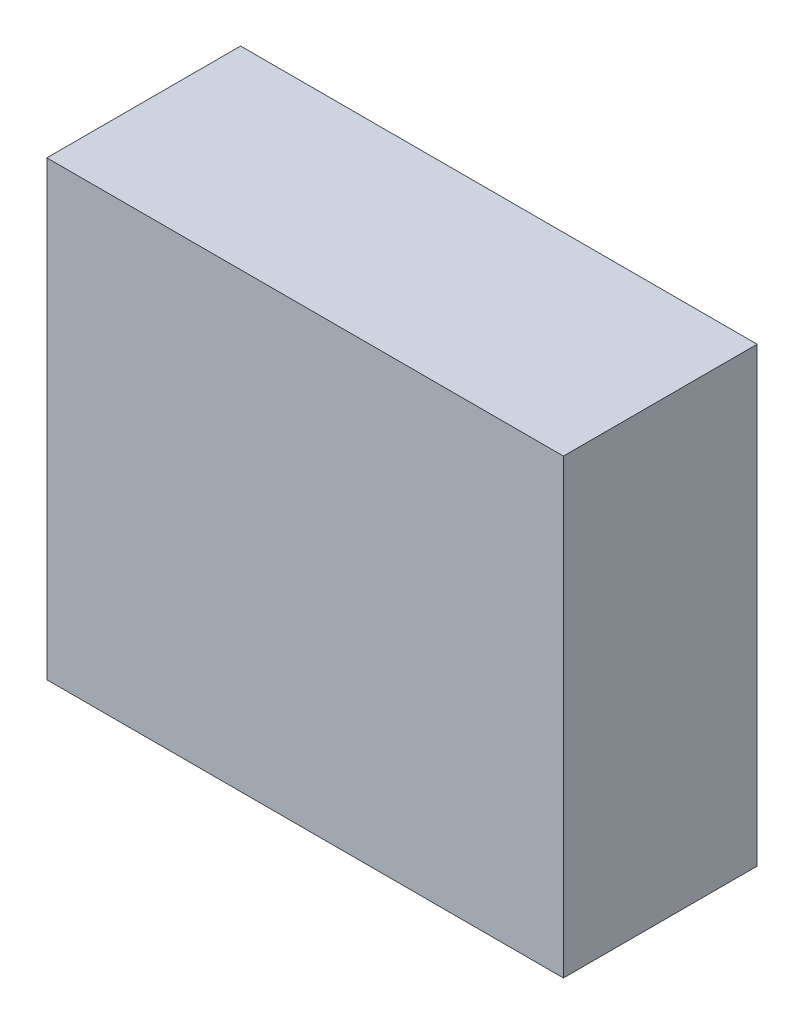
ISO-10303-21;
HEADER;
FILE_DESCRIPTION(('STEP AP214'),'2;1');
FILE_NAME('part.step','',(''),(''),'','','');
FILE_SCHEMA(('AUTOMOTIVE_DESIGN { 1 0 10303 214 1 1 1 1 }'));
ENDSEC;
DATA;
#1=APPLICATION_CONTEXT('core data for automotive mechanical design processes');
#2=APPLICATION_PROTOCOL_DEFINITION('international standard','automotive_design',2000,#1);
#3=PRODUCT_CONTEXT('',#1,'mechanical');
#4=PRODUCT('Part','Part','',(#3));
#5=PRODUCT_RELATED_PRODUCT_CATEGORY('part','',(#4));
#6=PRODUCT_DEFINITION_FORMATION('','',#4);
#7=PRODUCT_DEFINITION_CONTEXT('part definition',#1,'design');
#8=PRODUCT_DEFINITION('design','',#6,#7);
#9=PRODUCT_DEFINITION_SHAPE('','',#8);
#10=(LENGTH_UNIT() NAMED_UNIT(*) SI_UNIT(.MILLI.,.METRE.));
#11=(NAMED_UNIT(*) PLANE_ANGLE_UNIT() SI_UNIT($,.RADIAN.));
#12=(NAMED_UNIT(*) SI_UNIT($,.STERADIAN.) SOLID_ANGLE_UNIT());
#13=UNCERTAINTY_MEASURE_WITH_UNIT(LENGTH_MEASURE(1.E-05),#10,'distance_accuracy_value','');
#14=(GEOMETRIC_REPRESENTATION_CONTEXT(3) GLOBAL_UNCERTAINTY_ASSIGNED_CONTEXT((#13)) GLOBAL_UNIT_ASSIGNED_CONTEXT((#10,
#11,#12)) REPRESENTATION_CONTEXT('',''));
#15=CARTESIAN_POINT('',(0.,0.,0.));
#16=DIRECTION('',(0.,0.,1.));
#17=DIRECTION('',(1.,0.,0.));
#18=AXIS2_PLACEMENT_3D('',#15,#16,#17);
#19=CARTESIAN_POINT('',(-1.1999976,-1.04999536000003,0.));
#20=DIRECTION('',(-1.,0.,0.));
#21=DIRECTION('',(0.,1.,0.));
#22=AXIS2_PLACEMENT_3D('',#19,#20,#21);
#23=PLANE('',#22);
#24=DIRECTION('',(0.,0.,1.));
#25=VECTOR('',#24,1.);
#26=CARTESIAN_POINT('',(-1.1999976,-1.04999536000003,0.));
#27=LINE('',#26,#25);
#28=CARTESIAN_POINT('',(-1.1999976,-1.04999536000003,0.));
#29=VERTEX_POINT('',#28);
#30=CARTESIAN_POINT('',(-1.1999976,-1.04999536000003,0.90000074));
#31=VERTEX_POINT('',#30);
#32=EDGE_CURVE('E11',#29,#31,#27,.T.);
#33=ORIENTED_EDGE('',*,*,#32,.T.);
#34=DIRECTION('',(0.,1.,0.));
#35=VECTOR('',#34,1.);
#36=CARTESIAN_POINT('',(-1.1999976,-1.04999536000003,0.90000074));
#37=LINE('',#36,#35);
#38=CARTESIAN_POINT('',(-1.1999976,1.05000297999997,0.90000074));
#39=VERTEX_POINT('',#38);
#40=EDGE_CURVE('E24',#31,#39,#37,.T.);
#41=ORIENTED_EDGE('',*,*,#40,.T.);
#42=DIRECTION('',(0.,0.,1.));
#43=VECTOR('',#42,1.);
#44=CARTESIAN_POINT('',(-1.1999976,1.05000297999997,0.));
#45=LINE('',#44,#43);
#46=CARTESIAN_POINT('',(-1.1999976,1.05000297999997,0.));
#47=VERTEX_POINT('',#46);
#48=EDGE_CURVE('E85',#47,#39,#45,.T.);
#49=ORIENTED_EDGE('',*,*,#48,.F.);
#50=DIRECTION('',(0.,1.,0.));
#51=VECTOR('',#50,1.);
#52=CARTESIAN_POINT('',(-1.1999976,-1.04999536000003,0.));
#53=LINE('',#52,#51);
#54=EDGE_CURVE('E83',#29,#47,#53,.T.);
#55=ORIENTED_EDGE('',*,*,#54,.F.);
#56=EDGE_LOOP('',(#33,#41,#49,#55));
#57=FACE_BOUND('',#56,.T.);
#58=ADVANCED_FACE('F17',(#57),#23,.T.);
#59=CARTESIAN_POINT('',(-1.1999976,1.05000297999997,0.));
#60=DIRECTION('',(0.,1.,0.));
#61=DIRECTION('',(1.,0.,0.));
#62=AXIS2_PLACEMENT_3D('',#59,#60,#61);
#63=PLANE('',#62);
#64=ORIENTED_EDGE('',*,*,#48,.T.);
#65=DIRECTION('',(1.,0.,0.));
#66=VECTOR('',#65,1.);
#67=CARTESIAN_POINT('',(-1.1999976,1.05000297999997,0.90000074));
#68=LINE('',#67,#66);
#69=CARTESIAN_POINT('',(1.20000014,1.05000297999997,0.90000074));
#70=VERTEX_POINT('',#69);
#71=EDGE_CURVE('E81',#39,#70,#68,.T.);
#72=ORIENTED_EDGE('',*,*,#71,.T.);
#73=DIRECTION('',(0.,0.,1.));
#74=VECTOR('',#73,1.);
#75=CARTESIAN_POINT('',(1.20000014,1.05000297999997,0.));
#76=LINE('',#75,#74);
#77=CARTESIAN_POINT('',(1.20000014,1.05000297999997,0.));
#78=VERTEX_POINT('',#77);
#79=EDGE_CURVE('E79',#78,#70,#76,.T.);
#80=ORIENTED_EDGE('',*,*,#79,.F.);
#81=DIRECTION('',(1.,0.,0.));
#82=VECTOR('',#81,1.);
#83=CARTESIAN_POINT('',(-1.1999976,1.05000297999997,0.));
#84=LINE('',#83,#82);
#85=EDGE_CURVE('E61',#47,#78,#84,.T.);
#86=ORIENTED_EDGE('',*,*,#85,.F.);
#87=EDGE_LOOP('',(#64,#72,#80,#86));
#88=FACE_BOUND('',#87,.T.);
#89=ADVANCED_FACE('F90',(#88),#63,.T.);
#90=CARTESIAN_POINT('',(1.20000014,1.05000297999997,0.));
#91=DIRECTION('',(1.,0.,0.));
#92=DIRECTION('',(0.,-1.,0.));
#93=AXIS2_PLACEMENT_3D('',#90,#91,#92);
#94=PLANE('',#93);
#95=ORIENTED_EDGE('',*,*,#79,.T.);
#96=DIRECTION('',(0.,-1.,0.));
#97=VECTOR('',#96,1.);
#98=CARTESIAN_POINT('',(1.20000014,1.05000297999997,0.90000074));
#99=LINE('',#98,#97);
#100=CARTESIAN_POINT('',(1.20000014,-1.04999790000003,0.90000074));
#101=VERTEX_POINT('',#100);
#102=EDGE_CURVE('E70',#70,#101,#99,.T.);
#103=ORIENTED_EDGE('',*,*,#102,.T.);
#104=DIRECTION('',(0.,0.,1.));
#105=VECTOR('',#104,1.);
#106=CARTESIAN_POINT('',(1.20000014,-1.04999790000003,0.));
#107=LINE('',#106,#105);
#108=CARTESIAN_POINT('',(1.20000014,-1.04999790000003,0.));
#109=VERTEX_POINT('',#108);
#110=EDGE_CURVE('E64',#109,#101,#107,.T.);
#111=ORIENTED_EDGE('',*,*,#110,.F.);
#112=DIRECTION('',(0.,-1.,0.));
#113=VECTOR('',#112,1.);
#114=CARTESIAN_POINT('',(1.20000014,1.05000297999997,0.));
#115=LINE('',#114,#113);
#116=EDGE_CURVE('E55',#78,#109,#115,.T.);
#117=ORIENTED_EDGE('',*,*,#116,.F.);
#118=EDGE_LOOP('',(#95,#103,#111,#117));
#119=FACE_BOUND('',#118,.T.);
#120=ADVANCED_FACE('F68',(#119),#94,.T.);
#121=CARTESIAN_POINT('',(1.20000014,-1.04999790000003,0.));
#122=DIRECTION('',(-1.05833436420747E-06,-0.99999999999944,0.));
#123=DIRECTION('',(-0.99999999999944,1.05833436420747E-06,0.));
#124=AXIS2_PLACEMENT_3D('',#121,#122,#123);
#125=PLANE('',#124);
#126=ORIENTED_EDGE('',*,*,#110,.T.);
#127=DIRECTION('',(-0.99999999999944,1.05833436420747E-06,0.));
#128=VECTOR('',#127,1.);
#129=CARTESIAN_POINT('',(1.20000014,-1.04999790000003,0.90000074));
#130=LINE('',#129,#128);
#131=EDGE_CURVE('E65',#101,#31,#130,.T.);
#132=ORIENTED_EDGE('',*,*,#131,.T.);
#133=ORIENTED_EDGE('',*,*,#32,.F.);
#134=DIRECTION('',(-0.99999999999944,1.05833436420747E-06,0.));
#135=VECTOR('',#134,1.);
#136=CARTESIAN_POINT('',(1.20000014,-1.04999790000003,0.));
#137=LINE('',#136,#135);
#138=EDGE_CURVE('E59',#109,#29,#137,.T.);
#139=ORIENTED_EDGE('',*,*,#138,.F.);
#140=EDGE_LOOP('',(#126,#132,#133,#139));
#141=FACE_BOUND('',#140,.T.);
#142=ADVANCED_FACE('F73',(#141),#125,.T.);
#143=CARTESIAN_POINT('',(-1.1999976,-1.04999536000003,0.));
#144=DIRECTION('',(0.,0.,1.));
#145=DIRECTION('',(1.,0.,0.));
#146=AXIS2_PLACEMENT_3D('',#143,#144,#145);
#147=PLANE('',#146);
#148=ORIENTED_EDGE('',*,*,#54,.T.);
#149=ORIENTED_EDGE('',*,*,#85,.T.);
#150=ORIENTED_EDGE('',*,*,#116,.T.);
#151=ORIENTED_EDGE('',*,*,#138,.T.);
#152=EDGE_LOOP('',(#148,#149,#150,#151));
#153=FACE_BOUND('',#152,.T.);
#154=ADVANCED_FACE('F58',(#153),#147,.F.);
#155=CARTESIAN_POINT('',(-1.1999976,-1.04999536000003,0.90000074));
#156=DIRECTION('',(0.,0.,1.));
#157=DIRECTION('',(1.,0.,0.));
#158=AXIS2_PLACEMENT_3D('',#155,#156,#157);
#159=PLANE('',#158);
#160=ORIENTED_EDGE('',*,*,#131,.F.);
#161=ORIENTED_EDGE('',*,*,#102,.F.);
#162=ORIENTED_EDGE('',*,*,#71,.F.);
#163=ORIENTED_EDGE('',*,*,#40,.F.);
#164=EDGE_LOOP('',(#160,#161,#162,#163));
#165=FACE_BOUND('',#164,.T.);
#166=ADVANCED_FACE('F91',(#165),#159,.T.);
#167=CLOSED_SHELL('',(#58,#89,#120,#142,#154,#166));
#168=MANIFOLD_SOLID_BREP('B1',#167);
#169=ADVANCED_BREP_SHAPE_REPRESENTATION('',(#18,#168),#14);
#170=SHAPE_DEFINITION_REPRESENTATION(#9,#169);
ENDSEC;
END-ISO-10303-21;
